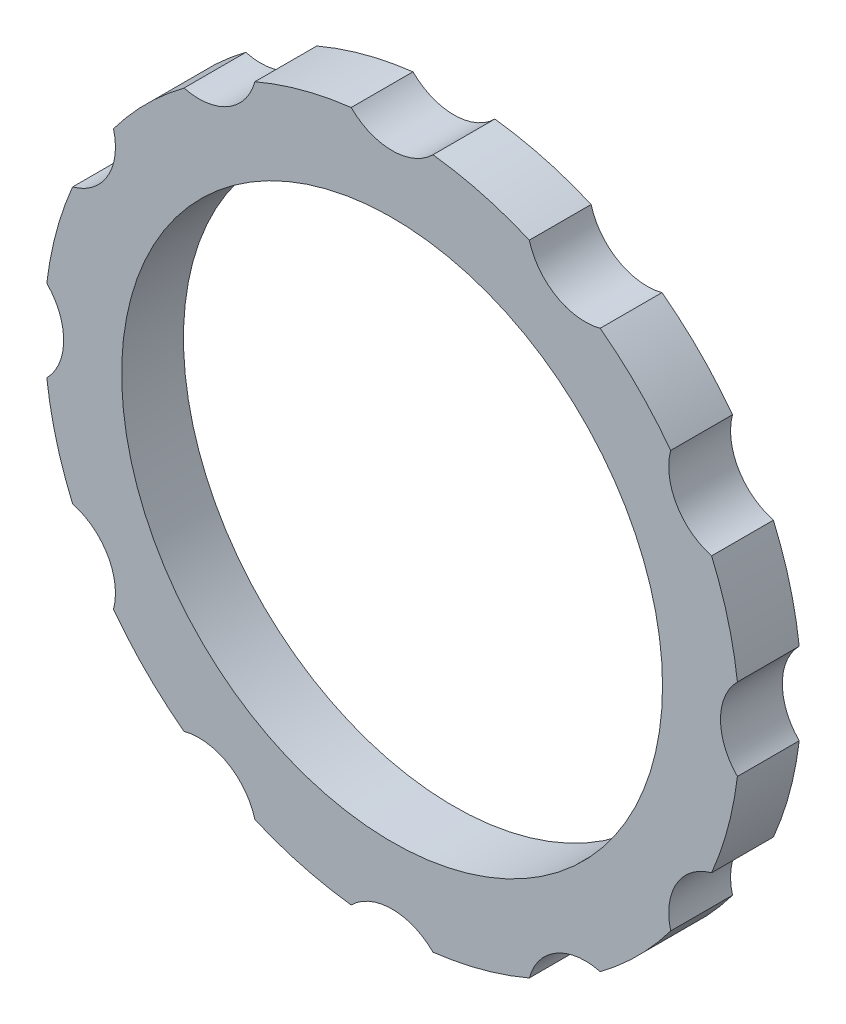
from build123d import *

# Parameters (mm, degrees)
SKETCH1_R           = 28.575
SKETCH1_R_2         = 22.225
BOSS_EXTRUDE1_DEPTH = 5.08
SKETCH2_R           = 4.7625
CUT_EXTRUDE1_DEPTH  = 41.729198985
CIRPATTERN1_COUNT   = 12


with BuildPart() as part:
    # Sketch1 → Boss-Extrude1 (new body)
    with BuildSketch(Plane.XY):
        Circle(SKETCH1_R)
        Circle(SKETCH1_R_2, mode=Mode.SUBTRACT)
    extrude(amount=BOSS_EXTRUDE1_DEPTH)

    # Sketch2 → Cut-Extrude1 (cut, through all)
    with BuildSketch(Plane.XY.offset(5.08)):
        with Locations((0, 31.75)):
            Circle(SKETCH2_R)
    cut_extrude1 = extrude(amount=-CUT_EXTRUDE1_DEPTH, mode=Mode.SUBTRACT)

    # CirPattern1: Cut-Extrude1 ×12 about axis
    cirpattern1_axis = Axis((0, 0, 0), (0, 0, 1))
    for i in range(1, CIRPATTERN1_COUNT):
        add(cut_extrude1.rotate(cirpattern1_axis, i * 360 / CIRPATTERN1_COUNT), mode=Mode.SUBTRACT)


solid = part.part
